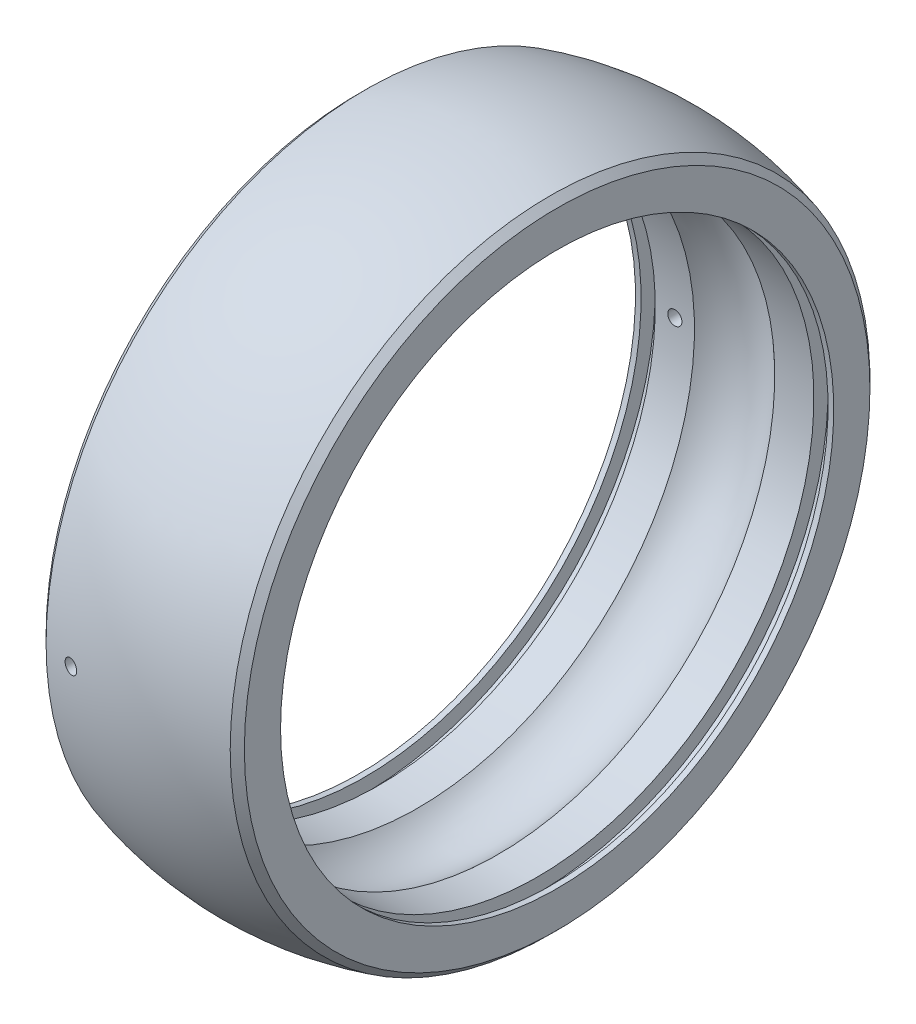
ISO-10303-21;
HEADER;
FILE_DESCRIPTION(('STEP AP214'),'2;1');
FILE_NAME('part.step','',(''),(''),'','','');
FILE_SCHEMA(('AUTOMOTIVE_DESIGN { 1 0 10303 214 1 1 1 1 }'));
ENDSEC;
DATA;
#1=APPLICATION_CONTEXT('core data for automotive mechanical design processes');
#2=APPLICATION_PROTOCOL_DEFINITION('international standard','automotive_design',2000,#1);
#3=PRODUCT_CONTEXT('',#1,'mechanical');
#4=PRODUCT('Part','Part','',(#3));
#5=PRODUCT_RELATED_PRODUCT_CATEGORY('part','',(#4));
#6=PRODUCT_DEFINITION_FORMATION('','',#4);
#7=PRODUCT_DEFINITION_CONTEXT('part definition',#1,'design');
#8=PRODUCT_DEFINITION('design','',#6,#7);
#9=PRODUCT_DEFINITION_SHAPE('','',#8);
#10=(LENGTH_UNIT() NAMED_UNIT(*) SI_UNIT(.MILLI.,.METRE.));
#11=(NAMED_UNIT(*) PLANE_ANGLE_UNIT() SI_UNIT($,.RADIAN.));
#12=(NAMED_UNIT(*) SI_UNIT($,.STERADIAN.) SOLID_ANGLE_UNIT());
#13=UNCERTAINTY_MEASURE_WITH_UNIT(LENGTH_MEASURE(1.E-05),#10,'distance_accuracy_value','');
#14=(GEOMETRIC_REPRESENTATION_CONTEXT(3) GLOBAL_UNCERTAINTY_ASSIGNED_CONTEXT((#13)) GLOBAL_UNIT_ASSIGNED_CONTEXT((#10,
#11,#12)) REPRESENTATION_CONTEXT('',''));
#15=CARTESIAN_POINT('',(0.,0.,0.));
#16=DIRECTION('',(0.,0.,1.));
#17=DIRECTION('',(1.,0.,0.));
#18=AXIS2_PLACEMENT_3D('',#15,#16,#17);
#19=CARTESIAN_POINT('',(-6.49999999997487,52.5,0.));
#20=DIRECTION('',(1.,0.,0.));
#21=DIRECTION('',(0.,0.,-1.));
#22=AXIS2_PLACEMENT_3D('',#19,#20,#21);
#23=CONICAL_SURFACE('',#22,22.5831795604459,0.785398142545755);
#24=CARTESIAN_POINT('',(-7.,52.5,0.));
#25=DIRECTION('',(-1.,0.,0.));
#26=DIRECTION('',(0.,0.,1.));
#27=AXIS2_PLACEMENT_3D('',#24,#25,#26);
#28=CIRCLE('',#27,22.0831795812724);
#29=CARTESIAN_POINT('',(-7.,52.5,22.0831795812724));
#30=VERTEX_POINT('',#29);
#31=EDGE_CURVE('E10',#30,#30,#28,.T.);
#32=ORIENTED_EDGE('',*,*,#31,.F.);
#33=EDGE_LOOP('',(#32));
#34=FACE_BOUND('',#33,.T.);
#35=CARTESIAN_POINT('',(-6.49999999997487,52.5,0.));
#36=DIRECTION('',(-1.,0.,0.));
#37=DIRECTION('',(0.,0.,1.));
#38=AXIS2_PLACEMENT_3D('',#35,#36,#37);
#39=CIRCLE('',#38,22.5831795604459);
#40=CARTESIAN_POINT('',(-6.49999999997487,52.5,22.5831795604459));
#41=VERTEX_POINT('',#40);
#42=EDGE_CURVE('E112',#41,#41,#39,.T.);
#43=ORIENTED_EDGE('',*,*,#42,.T.);
#44=EDGE_LOOP('',(#43));
#45=FACE_BOUND('',#44,.T.);
#46=ADVANCED_FACE('F29',(#34,#45),#23,.T.);
#47=CARTESIAN_POINT('',(-7.,74.5831795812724,0.));
#48=DIRECTION('',(1.,0.,0.));
#49=DIRECTION('',(0.,0.,-1.));
#50=AXIS2_PLACEMENT_3D('',#47,#48,#49);
#51=PLANE('',#50);
#52=CARTESIAN_POINT('',(-7.,52.5,0.));
#53=DIRECTION('',(-1.,0.,0.));
#54=DIRECTION('',(0.,0.,1.));
#55=AXIS2_PLACEMENT_3D('',#52,#53,#54);
#56=CIRCLE('',#55,19.5283);
#57=CARTESIAN_POINT('',(-7.,52.5,19.5283));
#58=VERTEX_POINT('',#57);
#59=EDGE_CURVE('E40',#58,#58,#56,.T.);
#60=ORIENTED_EDGE('',*,*,#59,.F.);
#61=EDGE_LOOP('',(#60));
#62=FACE_BOUND('',#61,.T.);
#63=ORIENTED_EDGE('',*,*,#31,.T.);
#64=EDGE_LOOP('',(#63));
#65=FACE_BOUND('',#64,.T.);
#66=ADVANCED_FACE('F97',(#62,#65),#51,.F.);
#67=CARTESIAN_POINT('',(-13.5635087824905,52.5,0.));
#68=DIRECTION('',(-1.,0.,0.));
#69=DIRECTION('',(0.,0.,1.));
#70=AXIS2_PLACEMENT_3D('',#67,#68,#69);
#71=CYLINDRICAL_SURFACE('',#70,19.5283);
#72=CARTESIAN_POINT('',(-6.6,52.5,0.));
#73=DIRECTION('',(-1.,0.,0.));
#74=DIRECTION('',(0.,0.,1.));
#75=AXIS2_PLACEMENT_3D('',#72,#73,#74);
#76=CIRCLE('',#75,19.5283);
#77=CARTESIAN_POINT('',(-6.6,52.5,19.5283));
#78=VERTEX_POINT('',#77);
#79=EDGE_CURVE('E45',#78,#78,#76,.T.);
#80=ORIENTED_EDGE('',*,*,#79,.F.);
#81=EDGE_LOOP('',(#80));
#82=FACE_BOUND('',#81,.T.);
#83=ORIENTED_EDGE('',*,*,#59,.T.);
#84=EDGE_LOOP('',(#83));
#85=FACE_BOUND('',#84,.T.);
#86=ADVANCED_FACE('F94',(#82,#85),#71,.F.);
#87=CARTESIAN_POINT('',(-6.6,72.0283,0.));
#88=DIRECTION('',(-1.,0.,0.));
#89=DIRECTION('',(0.,0.,1.));
#90=AXIS2_PLACEMENT_3D('',#87,#88,#89);
#91=PLANE('',#90);
#92=CARTESIAN_POINT('',(-6.6,52.5,0.));
#93=DIRECTION('',(-1.,0.,0.));
#94=DIRECTION('',(0.,0.,1.));
#95=AXIS2_PLACEMENT_3D('',#92,#93,#94);
#96=CIRCLE('',#95,20.5283);
#97=CARTESIAN_POINT('',(-6.6,52.5,20.5283));
#98=VERTEX_POINT('',#97);
#99=EDGE_CURVE('E153',#98,#98,#96,.T.);
#100=ORIENTED_EDGE('',*,*,#99,.F.);
#101=EDGE_LOOP('',(#100));
#102=FACE_BOUND('',#101,.T.);
#103=ORIENTED_EDGE('',*,*,#79,.T.);
#104=EDGE_LOOP('',(#103));
#105=FACE_BOUND('',#104,.T.);
#106=ADVANCED_FACE('F90',(#102,#105),#91,.F.);
#107=CARTESIAN_POINT('',(-13.5635087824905,52.5,0.));
#108=DIRECTION('',(-1.,0.,0.));
#109=DIRECTION('',(0.,0.,1.));
#110=AXIS2_PLACEMENT_3D('',#107,#108,#109);
#111=CYLINDRICAL_SURFACE('',#110,20.5283);
#112=CARTESIAN_POINT('',(-5.6,52.5,0.));
#113=DIRECTION('',(-1.,0.,0.));
#114=DIRECTION('',(0.,0.,1.));
#115=AXIS2_PLACEMENT_3D('',#112,#113,#114);
#116=CIRCLE('',#115,20.5283);
#117=CARTESIAN_POINT('',(-5.6,52.5,20.5283));
#118=VERTEX_POINT('',#117);
#119=EDGE_CURVE('E150',#118,#118,#116,.T.);
#120=ORIENTED_EDGE('',*,*,#119,.F.);
#121=EDGE_LOOP('',(#120));
#122=FACE_BOUND('',#121,.T.);
#123=ORIENTED_EDGE('',*,*,#99,.T.);
#124=EDGE_LOOP('',(#123));
#125=FACE_BOUND('',#124,.T.);
#126=ADVANCED_FACE('F86',(#122,#125),#111,.F.);
#127=CARTESIAN_POINT('',(-5.6,73.0283,0.));
#128=DIRECTION('',(1.,0.,0.));
#129=DIRECTION('',(0.,0.,-1.));
#130=AXIS2_PLACEMENT_3D('',#127,#128,#129);
#131=PLANE('',#130);
#132=CARTESIAN_POINT('',(-5.6,52.5,0.));
#133=DIRECTION('',(-1.,0.,0.));
#134=DIRECTION('',(0.,0.,1.));
#135=AXIS2_PLACEMENT_3D('',#132,#133,#134);
#136=CIRCLE('',#135,19.5283);
#137=CARTESIAN_POINT('',(-5.6,52.5,19.5283));
#138=VERTEX_POINT('',#137);
#139=EDGE_CURVE('E147',#138,#138,#136,.T.);
#140=ORIENTED_EDGE('',*,*,#139,.F.);
#141=EDGE_LOOP('',(#140));
#142=FACE_BOUND('',#141,.T.);
#143=ORIENTED_EDGE('',*,*,#119,.T.);
#144=EDGE_LOOP('',(#143));
#145=FACE_BOUND('',#144,.T.);
#146=ADVANCED_FACE('F80',(#142,#145),#131,.F.);
#147=CARTESIAN_POINT('',(-13.5635087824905,52.5,0.));
#148=DIRECTION('',(-1.,0.,0.));
#149=DIRECTION('',(0.,0.,1.));
#150=AXIS2_PLACEMENT_3D('',#147,#148,#149);
#151=CYLINDRICAL_SURFACE('',#150,19.5283);
#152=CARTESIAN_POINT('',(-3.71689980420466,52.5,19.5283));
#153=CARTESIAN_POINT('',(-3.71690104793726,52.5280802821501,19.5282999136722));
#154=CARTESIAN_POINT('',(-3.71927325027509,52.5561808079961,19.5282387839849));
#155=CARTESIAN_POINT('',(-3.72870332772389,52.611607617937,19.5280008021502));
#156=CARTESIAN_POINT('',(-3.73576681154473,52.6389329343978,19.5278238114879));
#157=CARTESIAN_POINT('',(-3.75437793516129,52.6919983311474,19.5273741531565));
#158=CARTESIAN_POINT('',(-3.76592339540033,52.7177391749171,19.5271015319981));
#159=CARTESIAN_POINT('',(-3.79316764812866,52.7669101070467,19.5264913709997));
#160=CARTESIAN_POINT('',(-3.80886542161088,52.7903407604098,19.5261538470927));
#161=CARTESIAN_POINT('',(-3.84397567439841,52.8342421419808,19.5254517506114));
#162=CARTESIAN_POINT('',(-3.86338930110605,52.854711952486,19.5250871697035));
#163=CARTESIAN_POINT('',(-3.90537830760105,52.8921029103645,19.5243721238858));
#164=CARTESIAN_POINT('',(-3.92795381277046,52.9090239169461,19.5240216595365));
#165=CARTESIAN_POINT('',(-3.97562853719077,52.9388378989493,19.523374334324));
#166=CARTESIAN_POINT('',(-4.00072805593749,52.9517303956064,19.5230774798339));
#167=CARTESIAN_POINT('',(-4.05273617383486,52.9731182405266,19.5225709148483));
#168=CARTESIAN_POINT('',(-4.0796447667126,52.9816136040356,19.5223612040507));
#169=CARTESIAN_POINT('',(-4.13450093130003,52.9939642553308,19.5220526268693));
#170=CARTESIAN_POINT('',(-4.16244827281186,52.9978205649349,19.521953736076));
#171=CARTESIAN_POINT('',(-4.21859380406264,53.0007867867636,19.5218778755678));
#172=CARTESIAN_POINT('',(-4.24679199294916,52.9998967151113,19.5219009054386));
#173=CARTESIAN_POINT('',(-4.3026318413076,52.9933963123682,19.5220662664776));
#174=CARTESIAN_POINT('',(-4.3302736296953,52.987787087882,19.522208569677));
#175=CARTESIAN_POINT('',(-4.38422308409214,52.9720093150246,19.5225963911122));
#176=CARTESIAN_POINT('',(-4.41053074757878,52.9618407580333,19.522841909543));
#177=CARTESIAN_POINT('',(-4.46106871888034,52.937231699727,19.5234085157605));
#178=CARTESIAN_POINT('',(-4.48529877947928,52.9227906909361,19.5237296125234));
#179=CARTESIAN_POINT('',(-4.53099102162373,52.890047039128,19.5244111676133));
#180=CARTESIAN_POINT('',(-4.55245319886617,52.8717443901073,19.5247716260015));
#181=CARTESIAN_POINT('',(-4.59200689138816,52.8317907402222,19.5254913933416));
#182=CARTESIAN_POINT('',(-4.610097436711,52.8101387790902,19.5258507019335));
#183=CARTESIAN_POINT('',(-4.64238686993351,52.764104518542,19.5265275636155));
#184=CARTESIAN_POINT('',(-4.65658575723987,52.7397222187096,19.5268451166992));
#185=CARTESIAN_POINT('',(-4.68068870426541,52.6889188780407,19.5274026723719));
#186=CARTESIAN_POINT('',(-4.69059273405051,52.6624978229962,19.5276426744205));
#187=CARTESIAN_POINT('',(-4.70582420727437,52.6083672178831,19.5280180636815));
#188=CARTESIAN_POINT('',(-4.71115165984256,52.5806576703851,19.5281534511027));
#189=CARTESIAN_POINT('',(-4.71707756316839,52.5247450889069,19.5283043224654));
#190=CARTESIAN_POINT('',(-4.7176773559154,52.4965421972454,19.5283198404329));
#191=CARTESIAN_POINT('',(-4.71413440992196,52.4404361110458,19.5282293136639));
#192=CARTESIAN_POINT('',(-4.70999167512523,52.4125329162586,19.5281232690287));
#193=CARTESIAN_POINT('',(-4.69708238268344,52.3578220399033,19.5278015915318));
#194=CARTESIAN_POINT('',(-4.68831643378,52.3310142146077,19.5275859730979));
#195=CARTESIAN_POINT('',(-4.66641016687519,52.2792506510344,19.5270694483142));
#196=CARTESIAN_POINT('',(-4.65326984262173,52.2542949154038,19.5267685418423));
#197=CARTESIAN_POINT('',(-4.62298437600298,52.2069377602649,19.5261152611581));
#198=CARTESIAN_POINT('',(-4.60583833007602,52.1845369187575,19.5257628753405));
#199=CARTESIAN_POINT('',(-4.5680294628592,52.1429312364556,19.5250463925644));
#200=CARTESIAN_POINT('',(-4.54736663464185,52.1237264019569,19.524682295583));
#201=CARTESIAN_POINT('',(-4.50310500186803,52.0890534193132,19.5239833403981));
#202=CARTESIAN_POINT('',(-4.47950551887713,52.0735861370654,19.5236484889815));
#203=CARTESIAN_POINT('',(-4.43004395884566,52.0468332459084,19.5230458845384));
#204=CARTESIAN_POINT('',(-4.40418188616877,52.0355476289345,19.5227781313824));
#205=CARTESIAN_POINT('',(-4.3509325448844,52.0174799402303,19.5223399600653));
#206=CARTESIAN_POINT('',(-4.3235454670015,52.0106973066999,19.5221695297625));
#207=CARTESIAN_POINT('',(-4.26802081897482,52.0018262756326,19.5219451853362));
#208=CARTESIAN_POINT('',(-4.23988324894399,51.9997378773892,19.5218912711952));
#209=CARTESIAN_POINT('',(-4.18366503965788,52.0003146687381,19.5219060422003));
#210=CARTESIAN_POINT('',(-4.15558438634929,52.0029784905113,19.5219746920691));
#211=CARTESIAN_POINT('',(-4.10026898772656,52.0129812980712,19.5222267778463));
#212=CARTESIAN_POINT('',(-4.07303424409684,52.0203202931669,19.5224102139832));
#213=CARTESIAN_POINT('',(-4.02018311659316,52.039464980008,19.522871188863));
#214=CARTESIAN_POINT('',(-3.99456676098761,52.0512707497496,19.5231487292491));
#215=CARTESIAN_POINT('',(-3.94568033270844,52.0790132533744,19.5237666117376));
#216=CARTESIAN_POINT('',(-3.92241017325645,52.094949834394,19.524106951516));
#217=CARTESIAN_POINT('',(-3.87887073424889,52.1305050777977,19.5248121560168));
#218=CARTESIAN_POINT('',(-3.8586019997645,52.1501244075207,19.5251770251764));
#219=CARTESIAN_POINT('',(-3.82164053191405,52.1924931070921,19.5258902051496));
#220=CARTESIAN_POINT('',(-3.80494868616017,52.2152432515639,19.5262385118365));
#221=CARTESIAN_POINT('',(-3.77561272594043,52.2632353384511,19.52687940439));
#222=CARTESIAN_POINT('',(-3.76297105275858,52.2884787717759,19.527171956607));
#223=CARTESIAN_POINT('',(-3.74211992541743,52.3407109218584,19.5276677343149));
#224=CARTESIAN_POINT('',(-3.73390517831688,52.3676975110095,19.527871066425));
#225=CARTESIAN_POINT('',(-3.72432145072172,52.412379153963,19.5281110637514));
#226=CARTESIAN_POINT('',(-3.72154182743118,52.4297841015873,19.5281816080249));
#227=CARTESIAN_POINT('',(-3.71783061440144,52.4647900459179,19.528276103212));
#228=CARTESIAN_POINT('',(-3.71689902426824,52.4823910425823,19.5283000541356));
#229=CARTESIAN_POINT('',(-3.71689980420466,52.5,19.5283));
#230=B_SPLINE_CURVE_WITH_KNOTS('',3,(#152,#153,#154,#155,#156,#157,#158,#159,#160,#161,#162,
#163,#164,#165,#166,#167,#168,#169,#170,#171,#172,#173,#174,#175,#176,#177,#178,#179,#180,#181,
#182,#183,#184,#185,#186,#187,#188,#189,#190,#191,#192,#193,#194,#195,#196,#197,#198,#199,#200,
#201,#202,#203,#204,#205,#206,#207,#208,#209,#210,#211,#212,#213,#214,#215,#216,#217,#218,#219,
#220,#221,#222,#223,#224,#225,#226,#227,#228,#229),.UNSPECIFIED.,.T.,.F.,(4,2,2,2,2,2,2,2,2,2,2,
2,2,2,2,2,2,2,2,2,2,2,2,2,2,2,2,2,2,2,2,2,2,2,2,2,2,2,4),(0.,0.0841765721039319,
0.168453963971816,0.252690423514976,0.336906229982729,0.42114808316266,0.505393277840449,
0.589648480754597,0.673903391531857,0.758139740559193,0.842375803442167,0.926592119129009,
1.01080859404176,1.09503507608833,1.17926168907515,1.26351249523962,1.34776331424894,
1.43201472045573,1.51626595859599,1.60049328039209,1.68472053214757,1.76893669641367,
1.85315298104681,1.93738828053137,2.02162374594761,2.10587870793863,2.1901335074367,
2.27437779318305,2.35862206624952,2.44284209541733,2.52706229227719,2.61128395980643,
2.69550251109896,2.77973633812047,2.86399104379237,2.94829643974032,3.0325008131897,
3.0852873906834,3.13807395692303),.UNSPECIFIED.);
#231=CARTESIAN_POINT('',(-3.71689980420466,52.5,19.5283));
#232=VERTEX_POINT('',#231);
#233=EDGE_CURVE('E71',#232,#232,#230,.T.);
#234=ORIENTED_EDGE('',*,*,#233,.T.);
#235=EDGE_LOOP('',(#234));
#236=FACE_BOUND('',#235,.T.);
#237=CARTESIAN_POINT('',(-3.71689980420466,52.5,-19.5283));
#238=CARTESIAN_POINT('',(-3.71690104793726,52.4719197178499,-19.5282999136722));
#239=CARTESIAN_POINT('',(-3.71927325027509,52.4438191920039,-19.5282387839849));
#240=CARTESIAN_POINT('',(-3.72870332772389,52.388392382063,-19.5280008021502));
#241=CARTESIAN_POINT('',(-3.73576681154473,52.3610670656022,-19.5278238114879));
#242=CARTESIAN_POINT('',(-3.75437793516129,52.3080016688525,-19.5273741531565));
#243=CARTESIAN_POINT('',(-3.76592339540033,52.2822608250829,-19.5271015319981));
#244=CARTESIAN_POINT('',(-3.79316764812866,52.2330898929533,-19.5264913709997));
#245=CARTESIAN_POINT('',(-3.80886542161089,52.2096592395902,-19.5261538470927));
#246=CARTESIAN_POINT('',(-3.84397567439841,52.1657578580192,-19.5254517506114));
#247=CARTESIAN_POINT('',(-3.86338930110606,52.145288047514,-19.5250871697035));
#248=CARTESIAN_POINT('',(-3.90537830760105,52.1078970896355,-19.5243721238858));
#249=CARTESIAN_POINT('',(-3.92795381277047,52.0909760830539,-19.5240216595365));
#250=CARTESIAN_POINT('',(-3.97562853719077,52.0611621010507,-19.523374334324));
#251=CARTESIAN_POINT('',(-4.00072805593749,52.0482696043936,-19.5230774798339));
#252=CARTESIAN_POINT('',(-4.05273617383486,52.0268817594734,-19.5225709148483));
#253=CARTESIAN_POINT('',(-4.0796447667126,52.0183863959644,-19.5223612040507));
#254=CARTESIAN_POINT('',(-4.13450093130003,52.0060357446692,-19.5220526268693));
#255=CARTESIAN_POINT('',(-4.16244827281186,52.0021794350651,-19.521953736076));
#256=CARTESIAN_POINT('',(-4.21859380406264,51.9992132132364,-19.5218778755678));
#257=CARTESIAN_POINT('',(-4.24679199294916,52.0001032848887,-19.5219009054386));
#258=CARTESIAN_POINT('',(-4.3026318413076,52.0066036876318,-19.5220662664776));
#259=CARTESIAN_POINT('',(-4.3302736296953,52.012212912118,-19.522208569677));
#260=CARTESIAN_POINT('',(-4.38422308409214,52.0279906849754,-19.5225963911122));
#261=CARTESIAN_POINT('',(-4.41053074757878,52.0381592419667,-19.522841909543));
#262=CARTESIAN_POINT('',(-4.46106871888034,52.062768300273,-19.5234085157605));
#263=CARTESIAN_POINT('',(-4.48529877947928,52.0772093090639,-19.5237296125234));
#264=CARTESIAN_POINT('',(-4.53099102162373,52.109952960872,-19.5244111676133));
#265=CARTESIAN_POINT('',(-4.55245319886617,52.1282556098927,-19.5247716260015));
#266=CARTESIAN_POINT('',(-4.59200689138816,52.1682092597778,-19.5254913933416));
#267=CARTESIAN_POINT('',(-4.610097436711,52.1898612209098,-19.5258507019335));
#268=CARTESIAN_POINT('',(-4.64238686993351,52.235895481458,-19.5265275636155));
#269=CARTESIAN_POINT('',(-4.65658575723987,52.2602777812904,-19.5268451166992));
#270=CARTESIAN_POINT('',(-4.68068870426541,52.3110811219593,-19.5274026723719));
#271=CARTESIAN_POINT('',(-4.69059273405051,52.3375021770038,-19.5276426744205));
#272=CARTESIAN_POINT('',(-4.70582420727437,52.3916327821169,-19.5280180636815));
#273=CARTESIAN_POINT('',(-4.71115165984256,52.4193423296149,-19.5281534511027));
#274=CARTESIAN_POINT('',(-4.71707756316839,52.4752549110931,-19.5283043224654));
#275=CARTESIAN_POINT('',(-4.7176773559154,52.5034578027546,-19.5283198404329));
#276=CARTESIAN_POINT('',(-4.71413440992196,52.5595638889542,-19.5282293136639));
#277=CARTESIAN_POINT('',(-4.70999167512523,52.5874670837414,-19.5281232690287));
#278=CARTESIAN_POINT('',(-4.69708238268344,52.6421779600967,-19.5278015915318));
#279=CARTESIAN_POINT('',(-4.68831643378,52.6689857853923,-19.5275859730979));
#280=CARTESIAN_POINT('',(-4.66641016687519,52.7207493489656,-19.5270694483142));
#281=CARTESIAN_POINT('',(-4.65326984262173,52.7457050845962,-19.5267685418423));
#282=CARTESIAN_POINT('',(-4.62298437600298,52.7930622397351,-19.5261152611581));
#283=CARTESIAN_POINT('',(-4.60583833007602,52.8154630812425,-19.5257628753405));
#284=CARTESIAN_POINT('',(-4.5680294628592,52.8570687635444,-19.5250463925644));
#285=CARTESIAN_POINT('',(-4.54736663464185,52.8762735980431,-19.524682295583));
#286=CARTESIAN_POINT('',(-4.50310500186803,52.9109465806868,-19.5239833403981));
#287=CARTESIAN_POINT('',(-4.47950551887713,52.9264138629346,-19.5236484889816));
#288=CARTESIAN_POINT('',(-4.43004395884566,52.9531667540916,-19.5230458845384));
#289=CARTESIAN_POINT('',(-4.40418188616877,52.9644523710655,-19.5227781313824));
#290=CARTESIAN_POINT('',(-4.3509325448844,52.9825200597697,-19.5223399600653));
#291=CARTESIAN_POINT('',(-4.3235454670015,52.9893026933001,-19.5221695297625));
#292=CARTESIAN_POINT('',(-4.26802081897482,52.9981737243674,-19.5219451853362));
#293=CARTESIAN_POINT('',(-4.23988324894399,53.0002621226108,-19.5218912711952));
#294=CARTESIAN_POINT('',(-4.18366503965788,52.9996853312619,-19.5219060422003));
#295=CARTESIAN_POINT('',(-4.15558438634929,52.9970215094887,-19.5219746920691));
#296=CARTESIAN_POINT('',(-4.10026898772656,52.9870187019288,-19.5222267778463));
#297=CARTESIAN_POINT('',(-4.07303424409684,52.9796797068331,-19.5224102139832));
#298=CARTESIAN_POINT('',(-4.02018311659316,52.960535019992,-19.522871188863));
#299=CARTESIAN_POINT('',(-3.9945667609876,52.9487292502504,-19.5231487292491));
#300=CARTESIAN_POINT('',(-3.94568033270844,52.9209867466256,-19.5237666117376));
#301=CARTESIAN_POINT('',(-3.92241017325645,52.905050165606,-19.524106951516));
#302=CARTESIAN_POINT('',(-3.8788707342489,52.8694949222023,-19.5248121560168));
#303=CARTESIAN_POINT('',(-3.8586019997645,52.8498755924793,-19.5251770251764));
#304=CARTESIAN_POINT('',(-3.82164053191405,52.8075068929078,-19.5258902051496));
#305=CARTESIAN_POINT('',(-3.80494868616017,52.7847567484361,-19.5262385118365));
#306=CARTESIAN_POINT('',(-3.77561272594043,52.7367646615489,-19.52687940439));
#307=CARTESIAN_POINT('',(-3.76297105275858,52.7115212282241,-19.527171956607));
#308=CARTESIAN_POINT('',(-3.74211992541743,52.6592890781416,-19.5276677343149));
#309=CARTESIAN_POINT('',(-3.73390517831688,52.6323024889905,-19.527871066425));
#310=CARTESIAN_POINT('',(-3.72432145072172,52.587620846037,-19.5281110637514));
#311=CARTESIAN_POINT('',(-3.72154182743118,52.5702158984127,-19.5281816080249));
#312=CARTESIAN_POINT('',(-3.71783061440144,52.5352099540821,-19.528276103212));
#313=CARTESIAN_POINT('',(-3.71689902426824,52.5176089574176,-19.5283000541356));
#314=CARTESIAN_POINT('',(-3.71689980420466,52.5,-19.5283));
#315=B_SPLINE_CURVE_WITH_KNOTS('',3,(#237,#238,#239,#240,#241,#242,#243,#244,#245,#246,#247,
#248,#249,#250,#251,#252,#253,#254,#255,#256,#257,#258,#259,#260,#261,#262,#263,#264,#265,#266,
#267,#268,#269,#270,#271,#272,#273,#274,#275,#276,#277,#278,#279,#280,#281,#282,#283,#284,#285,
#286,#287,#288,#289,#290,#291,#292,#293,#294,#295,#296,#297,#298,#299,#300,#301,#302,#303,#304,
#305,#306,#307,#308,#309,#310,#311,#312,#313,#314),.UNSPECIFIED.,.T.,.F.,(4,2,2,2,2,2,2,2,2,2,2,
2,2,2,2,2,2,2,2,2,2,2,2,2,2,2,2,2,2,2,2,2,2,2,2,2,2,2,4),(0.,0.0841765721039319,
0.168453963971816,0.252690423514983,0.336906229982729,0.421148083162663,0.505393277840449,
0.589648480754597,0.673903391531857,0.758139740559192,0.842375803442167,0.926592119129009,
1.01080859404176,1.09503507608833,1.17926168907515,1.26351249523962,1.34776331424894,
1.43201472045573,1.51626595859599,1.60049328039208,1.68472053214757,1.76893669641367,
1.85315298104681,1.93738828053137,2.02162374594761,2.10587870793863,2.1901335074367,
2.27437779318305,2.35862206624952,2.44284209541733,2.52706229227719,2.61128395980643,
2.69550251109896,2.77973633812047,2.86399104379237,2.94829643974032,3.0325008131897,
3.08528739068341,3.13807395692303),.UNSPECIFIED.);
#316=CARTESIAN_POINT('',(-3.71689980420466,52.5,-19.5283));
#317=VERTEX_POINT('',#316);
#318=EDGE_CURVE('E66',#317,#317,#315,.T.);
#319=ORIENTED_EDGE('',*,*,#318,.T.);
#320=EDGE_LOOP('',(#319));
#321=FACE_BOUND('',#320,.T.);
#322=CARTESIAN_POINT('',(-2.83443294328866,52.5,0.));
#323=DIRECTION('',(-1.,0.,0.));
#324=DIRECTION('',(0.,0.,1.));
#325=AXIS2_PLACEMENT_3D('',#322,#323,#324);
#326=CIRCLE('',#325,19.5283);
#327=CARTESIAN_POINT('',(-2.83443294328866,52.5,19.5283));
#328=VERTEX_POINT('',#327);
#329=EDGE_CURVE('E144',#328,#328,#326,.T.);
#330=ORIENTED_EDGE('',*,*,#329,.F.);
#331=EDGE_LOOP('',(#330));
#332=FACE_BOUND('',#331,.T.);
#333=ORIENTED_EDGE('',*,*,#139,.T.);
#334=EDGE_LOOP('',(#333));
#335=FACE_BOUND('',#334,.T.);
#336=ADVANCED_FACE('F74',(#236,#321,#332,#335),#151,.F.);
#337=CARTESIAN_POINT('',(0.,52.5,0.));
#338=DIRECTION('',(-1.,0.,0.));
#339=DIRECTION('',(0.,0.,1.));
#340=AXIS2_PLACEMENT_3D('',#337,#338,#339);
#341=TOROIDAL_SURFACE('',#340,16.75,3.96899999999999);
#342=CARTESIAN_POINT('',(2.83443294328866,52.5,0.));
#343=DIRECTION('',(-1.,0.,0.));
#344=DIRECTION('',(0.,0.,1.));
#345=AXIS2_PLACEMENT_3D('',#342,#343,#344);
#346=CIRCLE('',#345,19.5283);
#347=CARTESIAN_POINT('',(2.83443294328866,52.5,19.5283));
#348=VERTEX_POINT('',#347);
#349=EDGE_CURVE('E141',#348,#348,#346,.T.);
#350=ORIENTED_EDGE('',*,*,#349,.F.);
#351=EDGE_LOOP('',(#350));
#352=FACE_BOUND('',#351,.T.);
#353=ORIENTED_EDGE('',*,*,#329,.T.);
#354=EDGE_LOOP('',(#353));
#355=FACE_BOUND('',#354,.T.);
#356=ADVANCED_FACE('F79',(#352,#355),#341,.F.);
#357=CARTESIAN_POINT('',(-13.5635087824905,52.5,0.));
#358=DIRECTION('',(-1.,0.,0.));
#359=DIRECTION('',(0.,0.,1.));
#360=AXIS2_PLACEMENT_3D('',#357,#358,#359);
#361=CYLINDRICAL_SURFACE('',#360,19.5283);
#362=CARTESIAN_POINT('',(5.6,52.5,0.));
#363=DIRECTION('',(-1.,0.,0.));
#364=DIRECTION('',(0.,0.,1.));
#365=AXIS2_PLACEMENT_3D('',#362,#363,#364);
#366=CIRCLE('',#365,19.5283);
#367=CARTESIAN_POINT('',(5.6,52.5,19.5283));
#368=VERTEX_POINT('',#367);
#369=EDGE_CURVE('E138',#368,#368,#366,.T.);
#370=ORIENTED_EDGE('',*,*,#369,.F.);
#371=EDGE_LOOP('',(#370));
#372=FACE_BOUND('',#371,.T.);
#373=ORIENTED_EDGE('',*,*,#349,.T.);
#374=EDGE_LOOP('',(#373));
#375=FACE_BOUND('',#374,.T.);
#376=ADVANCED_FACE('F168',(#372,#375),#361,.F.);
#377=CARTESIAN_POINT('',(5.6,72.0283,0.));
#378=DIRECTION('',(-1.,0.,0.));
#379=DIRECTION('',(0.,0.,1.));
#380=AXIS2_PLACEMENT_3D('',#377,#378,#379);
#381=PLANE('',#380);
#382=CARTESIAN_POINT('',(5.6,52.5,0.));
#383=DIRECTION('',(-1.,0.,0.));
#384=DIRECTION('',(0.,0.,1.));
#385=AXIS2_PLACEMENT_3D('',#382,#383,#384);
#386=CIRCLE('',#385,20.5283);
#387=CARTESIAN_POINT('',(5.6,52.5,20.5283));
#388=VERTEX_POINT('',#387);
#389=EDGE_CURVE('E135',#388,#388,#386,.T.);
#390=ORIENTED_EDGE('',*,*,#389,.F.);
#391=EDGE_LOOP('',(#390));
#392=FACE_BOUND('',#391,.T.);
#393=ORIENTED_EDGE('',*,*,#369,.T.);
#394=EDGE_LOOP('',(#393));
#395=FACE_BOUND('',#394,.T.);
#396=ADVANCED_FACE('F173',(#392,#395),#381,.F.);
#397=CARTESIAN_POINT('',(-13.5635087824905,52.5,0.));
#398=DIRECTION('',(-1.,0.,0.));
#399=DIRECTION('',(0.,0.,1.));
#400=AXIS2_PLACEMENT_3D('',#397,#398,#399);
#401=CYLINDRICAL_SURFACE('',#400,20.5283);
#402=CARTESIAN_POINT('',(6.6,52.5,0.));
#403=DIRECTION('',(-1.,0.,0.));
#404=DIRECTION('',(0.,0.,1.));
#405=AXIS2_PLACEMENT_3D('',#402,#403,#404);
#406=CIRCLE('',#405,20.5283);
#407=CARTESIAN_POINT('',(6.6,52.5,20.5283));
#408=VERTEX_POINT('',#407);
#409=EDGE_CURVE('E132',#408,#408,#406,.T.);
#410=ORIENTED_EDGE('',*,*,#409,.F.);
#411=EDGE_LOOP('',(#410));
#412=FACE_BOUND('',#411,.T.);
#413=ORIENTED_EDGE('',*,*,#389,.T.);
#414=EDGE_LOOP('',(#413));
#415=FACE_BOUND('',#414,.T.);
#416=ADVANCED_FACE('F180',(#412,#415),#401,.F.);
#417=CARTESIAN_POINT('',(6.6,73.0283,0.));
#418=DIRECTION('',(1.,0.,0.));
#419=DIRECTION('',(0.,0.,-1.));
#420=AXIS2_PLACEMENT_3D('',#417,#418,#419);
#421=PLANE('',#420);
#422=CARTESIAN_POINT('',(6.6,52.5,0.));
#423=DIRECTION('',(-1.,0.,0.));
#424=DIRECTION('',(0.,0.,1.));
#425=AXIS2_PLACEMENT_3D('',#422,#423,#424);
#426=CIRCLE('',#425,19.5283);
#427=CARTESIAN_POINT('',(6.6,52.5,19.5283));
#428=VERTEX_POINT('',#427);
#429=EDGE_CURVE('E129',#428,#428,#426,.T.);
#430=ORIENTED_EDGE('',*,*,#429,.F.);
#431=EDGE_LOOP('',(#430));
#432=FACE_BOUND('',#431,.T.);
#433=ORIENTED_EDGE('',*,*,#409,.T.);
#434=EDGE_LOOP('',(#433));
#435=FACE_BOUND('',#434,.T.);
#436=ADVANCED_FACE('F187',(#432,#435),#421,.F.);
#437=CARTESIAN_POINT('',(-13.5635087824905,52.5,0.));
#438=DIRECTION('',(-1.,0.,0.));
#439=DIRECTION('',(0.,0.,1.));
#440=AXIS2_PLACEMENT_3D('',#437,#438,#439);
#441=CYLINDRICAL_SURFACE('',#440,19.5283);
#442=CARTESIAN_POINT('',(7.,52.5,0.));
#443=DIRECTION('',(-1.,0.,0.));
#444=DIRECTION('',(0.,0.,1.));
#445=AXIS2_PLACEMENT_3D('',#442,#443,#444);
#446=CIRCLE('',#445,19.5283);
#447=CARTESIAN_POINT('',(7.,52.5,19.5283));
#448=VERTEX_POINT('',#447);
#449=EDGE_CURVE('E126',#448,#448,#446,.T.);
#450=ORIENTED_EDGE('',*,*,#449,.F.);
#451=EDGE_LOOP('',(#450));
#452=FACE_BOUND('',#451,.T.);
#453=ORIENTED_EDGE('',*,*,#429,.T.);
#454=EDGE_LOOP('',(#453));
#455=FACE_BOUND('',#454,.T.);
#456=ADVANCED_FACE('F191',(#452,#455),#441,.F.);
#457=CARTESIAN_POINT('',(7.,72.0283,0.));
#458=DIRECTION('',(-1.,0.,0.));
#459=DIRECTION('',(0.,0.,1.));
#460=AXIS2_PLACEMENT_3D('',#457,#458,#459);
#461=PLANE('',#460);
#462=CARTESIAN_POINT('',(7.,52.5,0.));
#463=DIRECTION('',(-1.,0.,0.));
#464=DIRECTION('',(0.,0.,1.));
#465=AXIS2_PLACEMENT_3D('',#462,#463,#464);
#466=CIRCLE('',#465,22.0831795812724);
#467=CARTESIAN_POINT('',(7.,52.5,22.0831795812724));
#468=VERTEX_POINT('',#467);
#469=EDGE_CURVE('E117',#468,#468,#466,.T.);
#470=ORIENTED_EDGE('',*,*,#469,.F.);
#471=EDGE_LOOP('',(#470));
#472=FACE_BOUND('',#471,.T.);
#473=ORIENTED_EDGE('',*,*,#449,.T.);
#474=EDGE_LOOP('',(#473));
#475=FACE_BOUND('',#474,.T.);
#476=ADVANCED_FACE('F195',(#472,#475),#461,.F.);
#477=CARTESIAN_POINT('',(7.,52.5,0.));
#478=DIRECTION('',(-1.,0.,0.));
#479=DIRECTION('',(0.,0.,1.));
#480=AXIS2_PLACEMENT_3D('',#477,#478,#479);
#481=CONICAL_SURFACE('',#480,22.0831795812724,0.785398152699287);
#482=CARTESIAN_POINT('',(6.5,52.5,0.));
#483=DIRECTION('',(-1.,0.,0.));
#484=DIRECTION('',(0.,0.,1.));
#485=AXIS2_PLACEMENT_3D('',#482,#483,#484);
#486=CIRCLE('',#485,22.5831795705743);
#487=CARTESIAN_POINT('',(6.5,52.5,22.5831795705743));
#488=VERTEX_POINT('',#487);
#489=EDGE_CURVE('E114',#488,#488,#486,.T.);
#490=ORIENTED_EDGE('',*,*,#489,.F.);
#491=EDGE_LOOP('',(#490));
#492=FACE_BOUND('',#491,.T.);
#493=ORIENTED_EDGE('',*,*,#469,.T.);
#494=EDGE_LOOP('',(#493));
#495=FACE_BOUND('',#494,.T.);
#496=ADVANCED_FACE('F198',(#492,#495),#481,.T.);
#497=CARTESIAN_POINT('',(6.5,75.0831795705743,0.));
#498=CARTESIAN_POINT('',(6.38635338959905,75.1153612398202,0.));
#499=CARTESIAN_POINT('',(6.18027991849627,75.1737157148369,0.));
#500=CARTESIAN_POINT('',(5.81506447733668,75.2702192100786,0.));
#501=CARTESIAN_POINT('',(5.34305817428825,75.3870857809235,0.));
#502=CARTESIAN_POINT('',(4.76202714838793,75.5154798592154,0.));
#503=CARTESIAN_POINT('',(4.14163129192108,75.6348248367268,0.));
#504=CARTESIAN_POINT('',(3.51496804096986,75.7386336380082,0.));
#505=CARTESIAN_POINT('',(2.88040538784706,75.8259231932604,0.));
#506=CARTESIAN_POINT('',(2.2223898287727,75.8976681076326,0.));
#507=CARTESIAN_POINT('',(1.55061598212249,75.952229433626,0.));
#508=CARTESIAN_POINT('',(0.861574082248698,75.987701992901,0.));
#509=CARTESIAN_POINT('',(0.169891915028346,76.0026129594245,0.));
#510=CARTESIAN_POINT('',(-0.495621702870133,75.9978551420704,0.));
#511=CARTESIAN_POINT('',(-1.14164703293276,75.9751085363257,0.));
#512=CARTESIAN_POINT('',(-1.85612626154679,75.9306239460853,0.));
#513=CARTESIAN_POINT('',(-2.58263701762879,75.8620673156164,0.));
#514=CARTESIAN_POINT('',(-3.32068288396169,75.7674617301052,0.));
#515=CARTESIAN_POINT('',(-4.06482958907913,75.650334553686,0.));
#516=CARTESIAN_POINT('',(-4.8728742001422,75.4947397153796,0.));
#517=CARTESIAN_POINT('',(-5.71194803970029,75.3017835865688,0.));
#518=CARTESIAN_POINT('',(-6.25007503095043,75.1525082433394,0.));
#519=CARTESIAN_POINT('',(-6.49999999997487,75.0831795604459,0.));
#520=B_SPLINE_CURVE_WITH_KNOTS('',3,(#497,#498,#499,#500,#501,#502,#503,#504,#505,#506,#507,
#508,#509,#510,#511,#512,#513,#514,#515,#516,#517,#518,#519),.UNSPECIFIED.,.F.,.F.,(4,1,1,1,1,1,
1,1,1,1,1,1,1,1,1,1,1,1,1,1,4),(0.,0.0269025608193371,0.0487819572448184,0.0860364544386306,
0.137649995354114,0.184294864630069,0.229919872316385,0.282314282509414,0.330167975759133,
0.380665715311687,0.435806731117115,0.487292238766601,0.538224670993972,0.587373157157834,
0.634508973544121,0.701258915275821,0.75354156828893,0.803966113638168,0.872814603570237,
0.940930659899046,0.999999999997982),.UNSPECIFIED.);
#521=CARTESIAN_POINT('',(-13.5635087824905,52.5,0.));
#522=DIRECTION('',(-1.,0.,0.));
#523=AXIS1_PLACEMENT('',#521,#522);
#524=SURFACE_OF_REVOLUTION('',#520,#523);
#525=CARTESIAN_POINT('',(-3.71689980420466,52.5,-23.2042139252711));
#526=CARTESIAN_POINT('',(-3.71689690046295,52.5277710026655,-23.2042144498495));
#527=CARTESIAN_POINT('',(-3.71921712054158,52.5555245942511,-23.2037928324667));
#528=CARTESIAN_POINT('',(-3.72842406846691,52.6102812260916,-23.2021196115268));
#529=CARTESIAN_POINT('',(-3.73531632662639,52.6372833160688,-23.2008670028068));
#530=CARTESIAN_POINT('',(-3.75344691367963,52.6896819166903,-23.1975713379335));
#531=CARTESIAN_POINT('',(-3.76467813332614,52.715080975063,-23.1955295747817));
#532=CARTESIAN_POINT('',(-3.79116336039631,52.7636564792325,-23.1907135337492));
#533=CARTESIAN_POINT('',(-3.80642302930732,52.7868297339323,-23.1879382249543));
#534=CARTESIAN_POINT('',(-3.84060187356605,52.8304105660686,-23.1817200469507));
#535=CARTESIAN_POINT('',(-3.8595413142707,52.8508017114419,-23.1782734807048));
#536=CARTESIAN_POINT('',(-3.9004995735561,52.8881496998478,-23.1708170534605));
#537=CARTESIAN_POINT('',(-3.92252269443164,52.9051016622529,-23.1668064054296));
#538=CARTESIAN_POINT('',(-3.96934483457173,52.9353207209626,-23.1582755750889));
#539=CARTESIAN_POINT('',(-3.99417961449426,52.9485305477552,-23.1537488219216));
#540=CARTESIAN_POINT('',(-4.04565580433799,52.9705952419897,-23.144361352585));
#541=CARTESIAN_POINT('',(-4.07229741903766,52.9794496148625,-23.1395005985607));
#542=CARTESIAN_POINT('',(-4.12706530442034,52.9926818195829,-23.1295039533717));
#543=CARTESIAN_POINT('',(-4.15520801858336,52.996989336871,-23.1243649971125));
#544=CARTESIAN_POINT('',(-4.21176941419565,53.0007755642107,-23.1140330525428));
#545=CARTESIAN_POINT('',(-4.24018771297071,53.0002602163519,-23.1088401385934));
#546=CARTESIAN_POINT('',(-4.29678057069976,52.9944036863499,-23.0984961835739));
#547=CARTESIAN_POINT('',(-4.32495109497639,52.9890221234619,-23.0933458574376));
#548=CARTESIAN_POINT('',(-4.37999814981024,52.9735150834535,-23.0832801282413));
#549=CARTESIAN_POINT('',(-4.40687475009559,52.9633898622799,-23.0783647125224));
#550=CARTESIAN_POINT('',(-4.45848515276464,52.9386942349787,-23.0689250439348));
#551=CARTESIAN_POINT('',(-4.48322460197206,52.9241360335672,-23.0643997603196));
#552=CARTESIAN_POINT('',(-4.52990627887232,52.8909561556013,-23.0558607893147));
#553=CARTESIAN_POINT('',(-4.55184897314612,52.87233515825,-23.0518470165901));
#554=CARTESIAN_POINT('',(-4.5920379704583,52.831778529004,-23.04449590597));
#555=CARTESIAN_POINT('',(-4.61032384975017,52.8098834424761,-23.0411513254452));
#556=CARTESIAN_POINT('',(-4.64292304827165,52.7632711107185,-23.035189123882));
#557=CARTESIAN_POINT('',(-4.65724229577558,52.7385581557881,-23.0325704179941));
#558=CARTESIAN_POINT('',(-4.68130182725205,52.6873967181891,-23.0281706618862));
#559=CARTESIAN_POINT('',(-4.69110947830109,52.6609809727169,-23.0263772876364));
#560=CARTESIAN_POINT('',(-4.70615932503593,52.6068382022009,-23.0236254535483));
#561=CARTESIAN_POINT('',(-4.71140189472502,52.5791112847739,-23.0226669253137));
#562=CARTESIAN_POINT('',(-4.71711614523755,52.5235307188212,-23.0216221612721));
#563=CARTESIAN_POINT('',(-4.71765078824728,52.4956837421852,-23.021524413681));
#564=CARTESIAN_POINT('',(-4.71409507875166,52.4402595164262,-23.0221745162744));
#565=CARTESIAN_POINT('',(-4.70999866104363,52.4126826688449,-23.0229234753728));
#566=CARTESIAN_POINT('',(-4.69733180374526,52.358761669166,-23.0252395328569));
#567=CARTESIAN_POINT('',(-4.68878413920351,52.3324119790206,-23.0268024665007));
#568=CARTESIAN_POINT('',(-4.66747490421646,52.2814940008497,-23.0306991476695));
#569=CARTESIAN_POINT('',(-4.65470737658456,52.2569282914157,-23.033033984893));
#570=CARTESIAN_POINT('',(-4.62526731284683,52.2101666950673,-23.0384181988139));
#571=CARTESIAN_POINT('',(-4.60857462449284,52.1879839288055,-23.0414712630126));
#572=CARTESIAN_POINT('',(-4.57178219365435,52.1466948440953,-23.0482009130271));
#573=CARTESIAN_POINT('',(-4.55167664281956,52.1275938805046,-23.0518785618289));
#574=CARTESIAN_POINT('',(-4.50834635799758,52.0927623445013,-23.0598045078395));
#575=CARTESIAN_POINT('',(-4.48508127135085,52.0770836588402,-23.0640601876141));
#576=CARTESIAN_POINT('',(-4.43636175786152,52.049873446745,-23.0729715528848));
#577=CARTESIAN_POINT('',(-4.41091074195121,52.0383355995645,-23.077626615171));
#578=CARTESIAN_POINT('',(-4.35804003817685,52.0194999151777,-23.0872955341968));
#579=CARTESIAN_POINT('',(-4.33059402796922,52.0122783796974,-23.0923141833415));
#580=CARTESIAN_POINT('',(-4.27494152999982,52.0025786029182,-23.1024882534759));
#581=CARTESIAN_POINT('',(-4.24673610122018,52.0000940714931,-23.1076434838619));
#582=CARTESIAN_POINT('',(-4.18997763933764,51.9999101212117,-23.1180142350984));
#583=CARTESIAN_POINT('',(-4.16142440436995,52.0022670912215,-23.1232297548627));
#584=CARTESIAN_POINT('',(-4.10514967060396,52.0118142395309,-23.1335048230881));
#585=CARTESIAN_POINT('',(-4.07742709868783,52.0189978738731,-23.1385645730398));
#586=CARTESIAN_POINT('',(-4.0235362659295,52.0380174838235,-23.1483959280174));
#587=CARTESIAN_POINT('',(-3.99736969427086,52.049858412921,-23.1531672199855));
#588=CARTESIAN_POINT('',(-3.94739061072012,52.0778798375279,-23.1622763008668));
#589=CARTESIAN_POINT('',(-3.92357791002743,52.0940599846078,-23.1666141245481));
#590=CARTESIAN_POINT('',(-3.87923982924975,52.1301423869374,-23.1746879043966));
#591=CARTESIAN_POINT('',(-3.85868457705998,52.1500066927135,-23.1784293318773));
#592=CARTESIAN_POINT('',(-3.82121193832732,52.1930076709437,-23.1852480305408));
#593=CARTESIAN_POINT('',(-3.80429392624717,52.2161437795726,-23.1883254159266));
#594=CARTESIAN_POINT('',(-3.77484656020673,52.2646664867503,-23.1936807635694));
#595=CARTESIAN_POINT('',(-3.76225542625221,52.2900143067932,-23.1959699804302));
#596=CARTESIAN_POINT('',(-3.7415234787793,52.342478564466,-23.1997388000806));
#597=CARTESIAN_POINT('',(-3.73337676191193,52.3695926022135,-23.2012194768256));
#598=CARTESIAN_POINT('',(-3.72049218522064,52.4309745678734,-23.2035611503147));
#599=CARTESIAN_POINT('',(-3.71690341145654,52.4655007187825,-23.2042132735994));
#600=CARTESIAN_POINT('',(-3.71689980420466,52.5,-23.2042139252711));
#601=B_SPLINE_CURVE_WITH_KNOTS('',3,(#525,#526,#527,#528,#529,#530,#531,#532,#533,#534,#535,
#536,#537,#538,#539,#540,#541,#542,#543,#544,#545,#546,#547,#548,#549,#550,#551,#552,#553,#554,
#555,#556,#557,#558,#559,#560,#561,#562,#563,#564,#565,#566,#567,#568,#569,#570,#571,#572,#573,
#574,#575,#576,#577,#578,#579,#580,#581,#582,#583,#584,#585,#586,#587,#588,#589,#590,#591,#592,
#593,#594,#595,#596,#597,#598,#599,#600),.UNSPECIFIED.,.T.,.F.,(4,2,2,2,2,2,2,2,2,2,2,2,2,2,2,2,
2,2,2,2,2,2,2,2,2,2,2,2,2,2,2,2,2,2,2,2,2,4),(0.,0.0831840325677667,0.166468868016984,
0.249617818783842,0.3328842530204,0.416622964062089,0.500479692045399,0.585557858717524,
0.670645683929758,0.757030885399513,0.84330966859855,0.930311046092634,1.01730772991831,
1.10406703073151,1.19081183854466,1.27655990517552,1.36217911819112,1.44647468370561,
1.53076334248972,1.61392301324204,1.69719172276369,1.78003850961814,1.8630027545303,
1.9464026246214,2.02994588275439,2.11467920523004,2.19928263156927,2.28534051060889,
2.37128403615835,2.45823421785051,2.54506675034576,2.63199188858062,2.71891004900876,
2.80497815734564,2.89103145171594,2.97579934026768,3.06045435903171,3.16379197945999),.UNSPECIFIED.);
#602=CARTESIAN_POINT('',(-3.71689980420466,52.5,-23.2042139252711));
#603=VERTEX_POINT('',#602);
#604=EDGE_CURVE('E32',#603,#603,#601,.T.);
#605=ORIENTED_EDGE('',*,*,#604,.T.);
#606=EDGE_LOOP('',(#605));
#607=FACE_BOUND('',#606,.T.);
#608=CARTESIAN_POINT('',(-3.71689980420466,52.5,23.2042139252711));
#609=CARTESIAN_POINT('',(-3.71689690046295,52.4722289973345,23.2042144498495));
#610=CARTESIAN_POINT('',(-3.71921712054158,52.4444754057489,23.2037928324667));
#611=CARTESIAN_POINT('',(-3.72842406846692,52.3897187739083,23.2021196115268));
#612=CARTESIAN_POINT('',(-3.7353163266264,52.3627166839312,23.2008670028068));
#613=CARTESIAN_POINT('',(-3.75344691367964,52.3103180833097,23.1975713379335));
#614=CARTESIAN_POINT('',(-3.76467813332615,52.284919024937,23.1955295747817));
#615=CARTESIAN_POINT('',(-3.79116336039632,52.2363435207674,23.1907135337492));
#616=CARTESIAN_POINT('',(-3.80642302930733,52.2131702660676,23.1879382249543));
#617=CARTESIAN_POINT('',(-3.84060187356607,52.1695894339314,23.1817200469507));
#618=CARTESIAN_POINT('',(-3.85954131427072,52.1491982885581,23.1782734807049));
#619=CARTESIAN_POINT('',(-3.90049957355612,52.1118503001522,23.1708170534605));
#620=CARTESIAN_POINT('',(-3.92252269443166,52.0948983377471,23.1668064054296));
#621=CARTESIAN_POINT('',(-3.96934483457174,52.0646792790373,23.1582755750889));
#622=CARTESIAN_POINT('',(-3.99417961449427,52.0514694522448,23.1537488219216));
#623=CARTESIAN_POINT('',(-4.045655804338,52.0294047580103,23.144361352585));
#624=CARTESIAN_POINT('',(-4.07229741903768,52.0205503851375,23.1395005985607));
#625=CARTESIAN_POINT('',(-4.12706530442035,52.0073181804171,23.1295039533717));
#626=CARTESIAN_POINT('',(-4.15520801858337,52.0030106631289,23.1243649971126));
#627=CARTESIAN_POINT('',(-4.21176941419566,51.9992244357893,23.1140330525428));
#628=CARTESIAN_POINT('',(-4.24018771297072,51.9997397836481,23.1088401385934));
#629=CARTESIAN_POINT('',(-4.29678057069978,52.0055963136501,23.0984961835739));
#630=CARTESIAN_POINT('',(-4.32495109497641,52.0109778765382,23.0933458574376));
#631=CARTESIAN_POINT('',(-4.37999814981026,52.0264849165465,23.0832801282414));
#632=CARTESIAN_POINT('',(-4.40687475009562,52.0366101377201,23.0783647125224));
#633=CARTESIAN_POINT('',(-4.45848515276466,52.0613057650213,23.0689250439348));
#634=CARTESIAN_POINT('',(-4.48322460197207,52.0758639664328,23.0643997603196));
#635=CARTESIAN_POINT('',(-4.52990627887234,52.1090438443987,23.0558607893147));
#636=CARTESIAN_POINT('',(-4.55184897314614,52.12766484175,23.0518470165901));
#637=CARTESIAN_POINT('',(-4.59203797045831,52.168221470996,23.04449590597));
#638=CARTESIAN_POINT('',(-4.61032384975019,52.190116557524,23.0411513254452));
#639=CARTESIAN_POINT('',(-4.64292304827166,52.2367288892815,23.035189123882));
#640=CARTESIAN_POINT('',(-4.65724229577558,52.2614418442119,23.0325704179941));
#641=CARTESIAN_POINT('',(-4.68130182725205,52.3126032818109,23.0281706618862));
#642=CARTESIAN_POINT('',(-4.69110947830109,52.3390190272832,23.0263772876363));
#643=CARTESIAN_POINT('',(-4.70615932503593,52.3931617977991,23.0236254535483));
#644=CARTESIAN_POINT('',(-4.71140189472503,52.4208887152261,23.0226669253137));
#645=CARTESIAN_POINT('',(-4.71711614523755,52.4764692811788,23.0216221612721));
#646=CARTESIAN_POINT('',(-4.71765078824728,52.5043162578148,23.021524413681));
#647=CARTESIAN_POINT('',(-4.71409507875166,52.5597404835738,23.0221745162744));
#648=CARTESIAN_POINT('',(-4.70999866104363,52.5873173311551,23.0229234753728));
#649=CARTESIAN_POINT('',(-4.69733180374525,52.641238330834,23.025239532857));
#650=CARTESIAN_POINT('',(-4.6887841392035,52.6675880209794,23.0268024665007));
#651=CARTESIAN_POINT('',(-4.66747490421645,52.7185059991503,23.0306991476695));
#652=CARTESIAN_POINT('',(-4.65470737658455,52.7430717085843,23.0330339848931));
#653=CARTESIAN_POINT('',(-4.62526731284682,52.7898333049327,23.0384181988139));
#654=CARTESIAN_POINT('',(-4.60857462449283,52.8120160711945,23.0414712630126));
#655=CARTESIAN_POINT('',(-4.57178219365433,52.8533051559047,23.0482009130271));
#656=CARTESIAN_POINT('',(-4.55167664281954,52.8724061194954,23.0518785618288));
#657=CARTESIAN_POINT('',(-4.50834635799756,52.9072376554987,23.0598045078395));
#658=CARTESIAN_POINT('',(-4.48508127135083,52.9229163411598,23.0640601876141));
#659=CARTESIAN_POINT('',(-4.4363617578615,52.950126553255,23.0729715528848));
#660=CARTESIAN_POINT('',(-4.4109107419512,52.9616644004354,23.077626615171));
#661=CARTESIAN_POINT('',(-4.35804003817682,52.9805000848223,23.0872955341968));
#662=CARTESIAN_POINT('',(-4.33059402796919,52.9877216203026,23.0923141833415));
#663=CARTESIAN_POINT('',(-4.2749415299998,52.9974213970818,23.1024882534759));
#664=CARTESIAN_POINT('',(-4.24673610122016,52.9999059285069,23.107643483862));
#665=CARTESIAN_POINT('',(-4.18997763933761,53.0000898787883,23.1180142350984));
#666=CARTESIAN_POINT('',(-4.16142440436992,52.9977329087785,23.1232297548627));
#667=CARTESIAN_POINT('',(-4.10514967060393,52.9881857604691,23.133504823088));
#668=CARTESIAN_POINT('',(-4.07742709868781,52.9810021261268,23.1385645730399));
#669=CARTESIAN_POINT('',(-4.02353626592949,52.9619825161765,23.1483959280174));
#670=CARTESIAN_POINT('',(-3.99736969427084,52.9501415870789,23.1531672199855));
#671=CARTESIAN_POINT('',(-3.94739061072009,52.922120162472,23.1622763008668));
#672=CARTESIAN_POINT('',(-3.92357791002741,52.9059400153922,23.1666141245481));
#673=CARTESIAN_POINT('',(-3.87923982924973,52.8698576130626,23.1746879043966));
#674=CARTESIAN_POINT('',(-3.85868457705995,52.8499933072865,23.1784293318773));
#675=CARTESIAN_POINT('',(-3.8212119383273,52.8069923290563,23.1852480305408));
#676=CARTESIAN_POINT('',(-3.80429392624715,52.7838562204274,23.1883254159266));
#677=CARTESIAN_POINT('',(-3.77484656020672,52.7353335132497,23.1936807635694));
#678=CARTESIAN_POINT('',(-3.7622554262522,52.7099856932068,23.1959699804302));
#679=CARTESIAN_POINT('',(-3.74152347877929,52.657521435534,23.1997388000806));
#680=CARTESIAN_POINT('',(-3.73337676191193,52.6304073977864,23.2012194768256));
#681=CARTESIAN_POINT('',(-3.72049218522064,52.5690254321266,23.2035611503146));
#682=CARTESIAN_POINT('',(-3.71690341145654,52.5344992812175,23.2042132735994));
#683=CARTESIAN_POINT('',(-3.71689980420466,52.5,23.2042139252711));
#684=B_SPLINE_CURVE_WITH_KNOTS('',3,(#608,#609,#610,#611,#612,#613,#614,#615,#616,#617,#618,
#619,#620,#621,#622,#623,#624,#625,#626,#627,#628,#629,#630,#631,#632,#633,#634,#635,#636,#637,
#638,#639,#640,#641,#642,#643,#644,#645,#646,#647,#648,#649,#650,#651,#652,#653,#654,#655,#656,
#657,#658,#659,#660,#661,#662,#663,#664,#665,#666,#667,#668,#669,#670,#671,#672,#673,#674,#675,
#676,#677,#678,#679,#680,#681,#682,#683),.UNSPECIFIED.,.T.,.F.,(4,2,2,2,2,2,2,2,2,2,2,2,2,2,2,2,
2,2,2,2,2,2,2,2,2,2,2,2,2,2,2,2,2,2,2,2,2,4),(0.,0.0831840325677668,0.166468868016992,
0.249617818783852,0.332884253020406,0.416622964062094,0.500479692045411,0.585557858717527,
0.67064568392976,0.757030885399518,0.843309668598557,0.930311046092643,1.01730772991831,
1.10406703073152,1.19081183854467,1.27655990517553,1.36217911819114,1.44647468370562,
1.53076334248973,1.61392301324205,1.6971917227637,1.78003850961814,1.86300275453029,
1.94640262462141,2.0299458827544,2.11467920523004,2.19928263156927,2.28534051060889,
2.37128403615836,2.45823421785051,2.54506675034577,2.63199188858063,2.71891004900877,
2.80497815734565,2.89103145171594,2.97579934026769,3.06045435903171,3.16379197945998),.UNSPECIFIED.);
#685=CARTESIAN_POINT('',(-3.71689980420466,52.5,23.2042139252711));
#686=VERTEX_POINT('',#685);
#687=EDGE_CURVE('E48',#686,#686,#684,.T.);
#688=ORIENTED_EDGE('',*,*,#687,.T.);
#689=EDGE_LOOP('',(#688));
#690=FACE_BOUND('',#689,.T.);
#691=ORIENTED_EDGE('',*,*,#42,.F.);
#692=EDGE_LOOP('',(#691));
#693=FACE_BOUND('',#692,.T.);
#694=ORIENTED_EDGE('',*,*,#489,.T.);
#695=EDGE_LOOP('',(#694));
#696=FACE_BOUND('',#695,.T.);
#697=ADVANCED_FACE('F52',(#607,#690,#693,#696),#524,.T.);
#698=CARTESIAN_POINT('',(-4.21689980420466,52.5,-23.5026129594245));
#699=DIRECTION('',(0.,0.,1.));
#700=DIRECTION('',(1.,0.,0.));
#701=AXIS2_PLACEMENT_3D('',#698,#699,#700);
#702=CYLINDRICAL_SURFACE('',#701,0.500000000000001);
#703=ORIENTED_EDGE('',*,*,#687,.F.);
#704=EDGE_LOOP('',(#703));
#705=FACE_BOUND('',#704,.T.);
#706=ORIENTED_EDGE('',*,*,#233,.F.);
#707=EDGE_LOOP('',(#706));
#708=FACE_BOUND('',#707,.T.);
#709=ADVANCED_FACE('F56',(#705,#708),#702,.F.);
#710=ORIENTED_EDGE('',*,*,#604,.F.);
#711=EDGE_LOOP('',(#710));
#712=FACE_BOUND('',#711,.T.);
#713=ORIENTED_EDGE('',*,*,#318,.F.);
#714=EDGE_LOOP('',(#713));
#715=FACE_BOUND('',#714,.T.);
#716=ADVANCED_FACE('F59',(#712,#715),#702,.F.);
#717=CLOSED_SHELL('',(#46,#66,#86,#106,#126,#146,#336,#356,#376,#396,#416,#436,#456,#476,#496,
#697,#709,#716));
#718=MANIFOLD_SOLID_BREP('B2',#717);
#719=ADVANCED_BREP_SHAPE_REPRESENTATION('',(#18,#718),#14);
#720=SHAPE_DEFINITION_REPRESENTATION(#9,#719);
ENDSEC;
END-ISO-10303-21;
